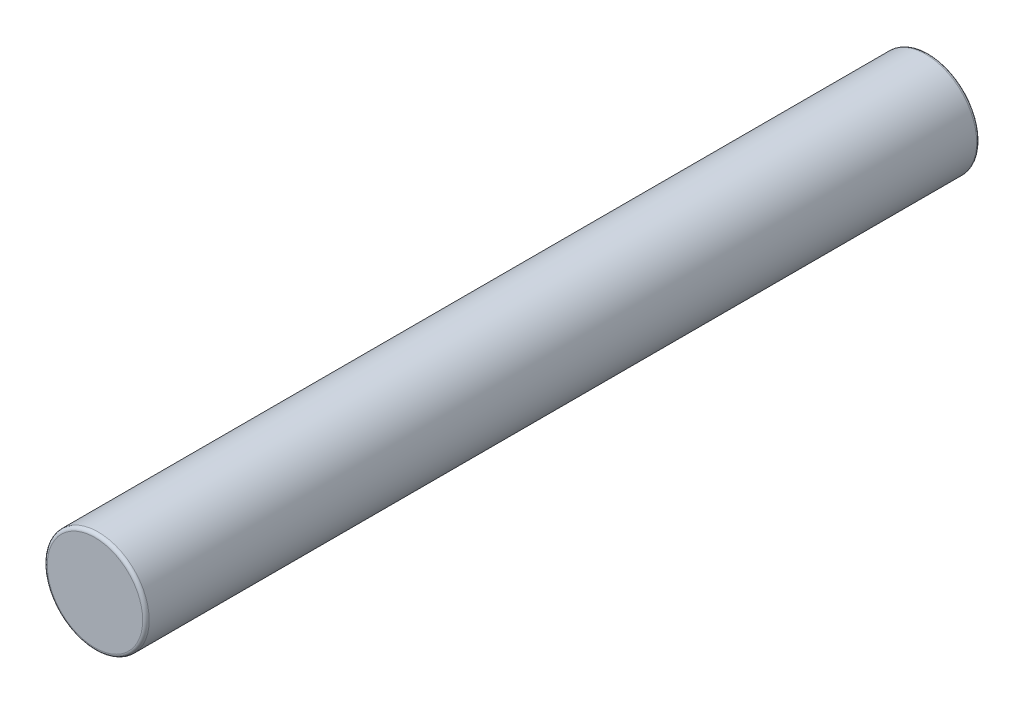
from build123d import *

# Parameters (mm, degrees)
SKETCH1_R      = 1.984375
EXTRUDE1_DEPTH = 16.2306
FILLET1_R      = 0.127


with BuildPart() as part:
    # Sketch1 → Extrude1 (new, symmetric)
    with BuildSketch(Plane.XY):
        Circle(SKETCH1_R)
    extrude(amount=EXTRUDE1_DEPTH, both=True)

    # Fillet1
    fillet1_edges = [part.edges().sort_by_distance(p)[0] for p in [
        (-1.984375, 0, -16.2306),
        (-1.984375, 0, 16.2306),
    ]]
    fillet(fillet1_edges, radius=FILLET1_R)


solid = part.part
